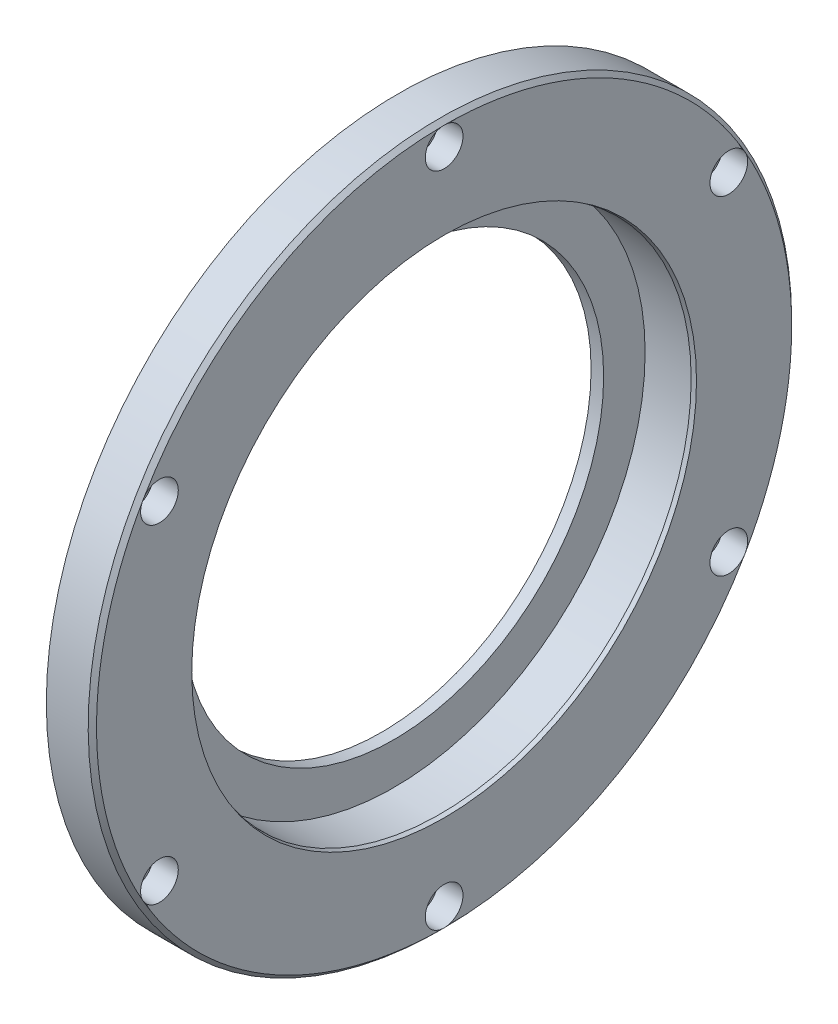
ISO-10303-21;
HEADER;
FILE_DESCRIPTION(('STEP AP214'),'2;1');
FILE_NAME('part.step','',(''),(''),'','','');
FILE_SCHEMA(('AUTOMOTIVE_DESIGN { 1 0 10303 214 1 1 1 1 }'));
ENDSEC;
DATA;
#1=APPLICATION_CONTEXT('core data for automotive mechanical design processes');
#2=APPLICATION_PROTOCOL_DEFINITION('international standard','automotive_design',2000,#1);
#3=PRODUCT_CONTEXT('',#1,'mechanical');
#4=PRODUCT('Part','Part','',(#3));
#5=PRODUCT_RELATED_PRODUCT_CATEGORY('part','',(#4));
#6=PRODUCT_DEFINITION_FORMATION('','',#4);
#7=PRODUCT_DEFINITION_CONTEXT('part definition',#1,'design');
#8=PRODUCT_DEFINITION('design','',#6,#7);
#9=PRODUCT_DEFINITION_SHAPE('','',#8);
#10=(LENGTH_UNIT() NAMED_UNIT(*) SI_UNIT(.MILLI.,.METRE.));
#11=(NAMED_UNIT(*) PLANE_ANGLE_UNIT() SI_UNIT($,.RADIAN.));
#12=(NAMED_UNIT(*) SI_UNIT($,.STERADIAN.) SOLID_ANGLE_UNIT());
#13=UNCERTAINTY_MEASURE_WITH_UNIT(LENGTH_MEASURE(1.E-05),#10,'distance_accuracy_value','');
#14=(GEOMETRIC_REPRESENTATION_CONTEXT(3) GLOBAL_UNCERTAINTY_ASSIGNED_CONTEXT((#13)) GLOBAL_UNIT_ASSIGNED_CONTEXT((#10,
#11,#12)) REPRESENTATION_CONTEXT('',''));
#15=CARTESIAN_POINT('',(0.,0.,0.));
#16=DIRECTION('',(0.,0.,1.));
#17=DIRECTION('',(1.,0.,0.));
#18=AXIS2_PLACEMENT_3D('',#15,#16,#17);
#19=CARTESIAN_POINT('',(0.,0.,0.));
#20=DIRECTION('',(1.,0.,0.));
#21=DIRECTION('',(0.,0.,-1.));
#22=AXIS2_PLACEMENT_3D('',#19,#20,#21);
#23=CYLINDRICAL_SURFACE('',#22,65.);
#24=CARTESIAN_POINT('',(-15.,0.,0.));
#25=DIRECTION('',(1.,0.,0.));
#26=DIRECTION('',(0.,0.,-1.));
#27=AXIS2_PLACEMENT_3D('',#24,#25,#26);
#28=CIRCLE('',#27,65.);
#29=CARTESIAN_POINT('',(-15.,0.,-65.));
#30=VERTEX_POINT('',#29);
#31=EDGE_CURVE('E11',#30,#30,#28,.T.);
#32=ORIENTED_EDGE('',*,*,#31,.T.);
#33=EDGE_LOOP('',(#32));
#34=FACE_BOUND('',#33,.T.);
#35=CARTESIAN_POINT('',(-16.,0.,0.));
#36=DIRECTION('',(1.,0.,0.));
#37=DIRECTION('',(0.,0.,-1.));
#38=AXIS2_PLACEMENT_3D('',#35,#36,#37);
#39=CIRCLE('',#38,65.);
#40=CARTESIAN_POINT('',(-16.,0.,-65.));
#41=VERTEX_POINT('',#40);
#42=EDGE_CURVE('E91',#41,#41,#39,.T.);
#43=ORIENTED_EDGE('',*,*,#42,.F.);
#44=EDGE_LOOP('',(#43));
#45=FACE_BOUND('',#44,.T.);
#46=ADVANCED_FACE('F34',(#34,#45),#23,.F.);
#47=CARTESIAN_POINT('',(-15.,65.,0.));
#48=DIRECTION('',(-1.,0.,0.));
#49=DIRECTION('',(0.,0.,1.));
#50=AXIS2_PLACEMENT_3D('',#47,#48,#49);
#51=PLANE('',#50);
#52=CARTESIAN_POINT('',(-15.,0.,0.));
#53=DIRECTION('',(1.,0.,0.));
#54=DIRECTION('',(0.,0.,-1.));
#55=AXIS2_PLACEMENT_3D('',#52,#53,#54);
#56=CIRCLE('',#55,50.1);
#57=CARTESIAN_POINT('',(-15.,0.,-50.1));
#58=VERTEX_POINT('',#57);
#59=EDGE_CURVE('E42',#58,#58,#56,.T.);
#60=ORIENTED_EDGE('',*,*,#59,.T.);
#61=EDGE_LOOP('',(#60));
#62=FACE_BOUND('',#61,.T.);
#63=ORIENTED_EDGE('',*,*,#31,.F.);
#64=EDGE_LOOP('',(#63));
#65=FACE_BOUND('',#64,.T.);
#66=ADVANCED_FACE('F194',(#62,#65),#51,.T.);
#67=CARTESIAN_POINT('',(0.,0.,0.));
#68=DIRECTION('',(1.,0.,0.));
#69=DIRECTION('',(0.,0.,-1.));
#70=AXIS2_PLACEMENT_3D('',#67,#68,#69);
#71=CYLINDRICAL_SURFACE('',#70,50.1);
#72=CARTESIAN_POINT('',(-12.,0.,0.));
#73=DIRECTION('',(1.,0.,0.));
#74=DIRECTION('',(0.,0.,-1.));
#75=AXIS2_PLACEMENT_3D('',#72,#73,#74);
#76=CIRCLE('',#75,50.1);
#77=CARTESIAN_POINT('',(-12.,0.,-50.1));
#78=VERTEX_POINT('',#77);
#79=EDGE_CURVE('E123',#78,#78,#76,.T.);
#80=ORIENTED_EDGE('',*,*,#79,.T.);
#81=EDGE_LOOP('',(#80));
#82=FACE_BOUND('',#81,.T.);
#83=ORIENTED_EDGE('',*,*,#59,.F.);
#84=EDGE_LOOP('',(#83));
#85=FACE_BOUND('',#84,.T.);
#86=ADVANCED_FACE('F199',(#82,#85),#71,.F.);
#87=CARTESIAN_POINT('',(-12.,50.1,0.));
#88=DIRECTION('',(1.,0.,0.));
#89=DIRECTION('',(0.,0.,-1.));
#90=AXIS2_PLACEMENT_3D('',#87,#88,#89);
#91=PLANE('',#90);
#92=CARTESIAN_POINT('',(-12.,0.,0.));
#93=DIRECTION('',(1.,0.,0.));
#94=DIRECTION('',(0.,0.,-1.));
#95=AXIS2_PLACEMENT_3D('',#92,#93,#94);
#96=CIRCLE('',#95,60.);
#97=CARTESIAN_POINT('',(-12.,0.,-60.));
#98=VERTEX_POINT('',#97);
#99=EDGE_CURVE('E120',#98,#98,#96,.T.);
#100=ORIENTED_EDGE('',*,*,#99,.T.);
#101=EDGE_LOOP('',(#100));
#102=FACE_BOUND('',#101,.T.);
#103=ORIENTED_EDGE('',*,*,#79,.F.);
#104=EDGE_LOOP('',(#103));
#105=FACE_BOUND('',#104,.T.);
#106=ADVANCED_FACE('F503',(#102,#105),#91,.T.);
#107=CARTESIAN_POINT('',(0.,0.,0.));
#108=DIRECTION('',(1.,0.,0.));
#109=DIRECTION('',(0.,0.,-1.));
#110=AXIS2_PLACEMENT_3D('',#107,#108,#109);
#111=CYLINDRICAL_SURFACE('',#110,60.);
#112=CARTESIAN_POINT('',(-1.,0.,0.));
#113=DIRECTION('',(1.,0.,0.));
#114=DIRECTION('',(0.,0.,-1.));
#115=AXIS2_PLACEMENT_3D('',#112,#113,#114);
#116=CIRCLE('',#115,60.);
#117=CARTESIAN_POINT('',(-1.,0.,-60.));
#118=VERTEX_POINT('',#117);
#119=EDGE_CURVE('E117',#118,#118,#116,.T.);
#120=ORIENTED_EDGE('',*,*,#119,.T.);
#121=EDGE_LOOP('',(#120));
#122=FACE_BOUND('',#121,.T.);
#123=ORIENTED_EDGE('',*,*,#99,.F.);
#124=EDGE_LOOP('',(#123));
#125=FACE_BOUND('',#124,.T.);
#126=ADVANCED_FACE('F494',(#122,#125),#111,.F.);
#127=CARTESIAN_POINT('',(-1.,0.,0.));
#128=DIRECTION('',(1.,0.,0.));
#129=DIRECTION('',(0.,0.,-1.));
#130=AXIS2_PLACEMENT_3D('',#127,#128,#129);
#131=CONICAL_SURFACE('',#130,60.,0.26179938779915);
#132=CARTESIAN_POINT('',(0.,0.,0.));
#133=DIRECTION('',(1.,0.,0.));
#134=DIRECTION('',(0.,0.,-1.));
#135=AXIS2_PLACEMENT_3D('',#132,#133,#134);
#136=CIRCLE('',#135,60.2679491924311);
#137=CARTESIAN_POINT('',(0.,0.,-60.2679491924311));
#138=VERTEX_POINT('',#137);
#139=EDGE_CURVE('E114',#138,#138,#136,.T.);
#140=ORIENTED_EDGE('',*,*,#139,.T.);
#141=EDGE_LOOP('',(#140));
#142=FACE_BOUND('',#141,.T.);
#143=ORIENTED_EDGE('',*,*,#119,.F.);
#144=EDGE_LOOP('',(#143));
#145=FACE_BOUND('',#144,.T.);
#146=ADVANCED_FACE('F486',(#142,#145),#131,.F.);
#147=CARTESIAN_POINT('',(0.,60.2679491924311,0.));
#148=DIRECTION('',(1.,0.,0.));
#149=DIRECTION('',(0.,0.,-1.));
#150=AXIS2_PLACEMENT_3D('',#147,#148,#149);
#151=PLANE('',#150);
#152=CARTESIAN_POINT('',(0.,0.,0.));
#153=DIRECTION('',(1.,0.,0.));
#154=DIRECTION('',(0.,0.,-1.));
#155=AXIS2_PLACEMENT_3D('',#152,#153,#154);
#156=CIRCLE('',#155,83.);
#157=CARTESIAN_POINT('',(0.,83.,0.));
#158=VERTEX_POINT('',#157);
#159=CARTESIAN_POINT('',(0.,41.5000000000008,71.8801085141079));
#160=VERTEX_POINT('',#159);
#161=EDGE_CURVE('E84',#158,#160,#156,.T.);
#162=ORIENTED_EDGE('',*,*,#161,.T.);
#163=CARTESIAN_POINT('',(0.,39.2500000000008,67.982994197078));
#164=DIRECTION('',(1.,0.,0.));
#165=DIRECTION('',(0.,0.,-1.));
#166=AXIS2_PLACEMENT_3D('',#163,#164,#165);
#167=CIRCLE('',#166,4.5);
#168=EDGE_CURVE('E48',#160,#160,#167,.T.);
#169=ORIENTED_EDGE('',*,*,#168,.F.);
#170=CARTESIAN_POINT('',(0.,-41.4999999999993,71.8801085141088));
#171=VERTEX_POINT('',#170);
#172=EDGE_CURVE('E54',#160,#171,#156,.T.);
#173=ORIENTED_EDGE('',*,*,#172,.T.);
#174=CARTESIAN_POINT('',(0.,-39.2499999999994,67.9829941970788));
#175=DIRECTION('',(1.,0.,0.));
#176=DIRECTION('',(0.,0.,-1.));
#177=AXIS2_PLACEMENT_3D('',#174,#175,#176);
#178=CIRCLE('',#177,4.5);
#179=EDGE_CURVE('E143',#171,#171,#178,.T.);
#180=ORIENTED_EDGE('',*,*,#179,.F.);
#181=CARTESIAN_POINT('',(0.,-83.,5.79586237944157E-13));
#182=VERTEX_POINT('',#181);
#183=EDGE_CURVE('E418',#171,#182,#156,.T.);
#184=ORIENTED_EDGE('',*,*,#183,.T.);
#185=CARTESIAN_POINT('',(0.,-78.5,5.48162887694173E-13));
#186=DIRECTION('',(1.,0.,0.));
#187=DIRECTION('',(0.,0.,-1.));
#188=AXIS2_PLACEMENT_3D('',#185,#186,#187);
#189=CIRCLE('',#188,4.5);
#190=EDGE_CURVE('E139',#182,#182,#189,.T.);
#191=ORIENTED_EDGE('',*,*,#190,.F.);
#192=CARTESIAN_POINT('',(0.,-41.5000000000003,-71.8801085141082));
#193=VERTEX_POINT('',#192);
#194=EDGE_CURVE('E417',#182,#193,#156,.T.);
#195=ORIENTED_EDGE('',*,*,#194,.T.);
#196=CARTESIAN_POINT('',(0.,-39.2500000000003,-67.9829941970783));
#197=DIRECTION('',(1.,0.,0.));
#198=DIRECTION('',(0.,0.,-1.));
#199=AXIS2_PLACEMENT_3D('',#196,#197,#198);
#200=CIRCLE('',#199,4.5);
#201=EDGE_CURVE('E135',#193,#193,#200,.T.);
#202=ORIENTED_EDGE('',*,*,#201,.F.);
#203=CARTESIAN_POINT('',(0.,41.4999999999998,-71.8801085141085));
#204=VERTEX_POINT('',#203);
#205=EDGE_CURVE('E81',#193,#204,#156,.T.);
#206=ORIENTED_EDGE('',*,*,#205,.T.);
#207=CARTESIAN_POINT('',(0.,39.2499999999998,-67.9829941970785));
#208=DIRECTION('',(1.,0.,0.));
#209=DIRECTION('',(0.,0.,-1.));
#210=AXIS2_PLACEMENT_3D('',#207,#208,#209);
#211=CIRCLE('',#210,4.5);
#212=EDGE_CURVE('E78',#204,#204,#211,.T.);
#213=ORIENTED_EDGE('',*,*,#212,.F.);
#214=EDGE_CURVE('E70',#204,#158,#156,.T.);
#215=ORIENTED_EDGE('',*,*,#214,.T.);
#216=CARTESIAN_POINT('',(0.,78.5,0.));
#217=DIRECTION('',(1.,0.,0.));
#218=DIRECTION('',(0.,0.,-1.));
#219=AXIS2_PLACEMENT_3D('',#216,#217,#218);
#220=CIRCLE('',#219,4.5);
#221=EDGE_CURVE('E75',#158,#158,#220,.T.);
#222=ORIENTED_EDGE('',*,*,#221,.F.);
#223=EDGE_LOOP('',(#162,#169,#173,#180,#184,#191,#195,#202,#206,#213,#215,#222));
#224=FACE_BOUND('',#223,.T.);
#225=ORIENTED_EDGE('',*,*,#139,.F.);
#226=EDGE_LOOP('',(#225));
#227=FACE_BOUND('',#226,.T.);
#228=ADVANCED_FACE('F73',(#224,#227),#151,.T.);
#229=CARTESIAN_POINT('',(0.,0.,0.));
#230=DIRECTION('',(-1.,0.,0.));
#231=DIRECTION('',(0.,0.,1.));
#232=AXIS2_PLACEMENT_3D('',#229,#230,#231);
#233=CONICAL_SURFACE('',#232,83.,0.785398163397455);
#234=CARTESIAN_POINT('',(-1.,0.,0.));
#235=DIRECTION('',(1.,0.,0.));
#236=DIRECTION('',(0.,0.,-1.));
#237=AXIS2_PLACEMENT_3D('',#234,#235,#236);
#238=CIRCLE('',#237,84.);
#239=CARTESIAN_POINT('',(-1.,0.,-84.));
#240=VERTEX_POINT('',#239);
#241=EDGE_CURVE('E82',#240,#240,#238,.T.);
#242=ORIENTED_EDGE('',*,*,#241,.T.);
#243=EDGE_LOOP('',(#242));
#244=FACE_BOUND('',#243,.T.);
#245=ORIENTED_EDGE('',*,*,#161,.F.);
#246=ORIENTED_EDGE('',*,*,#214,.F.);
#247=ORIENTED_EDGE('',*,*,#205,.F.);
#248=ORIENTED_EDGE('',*,*,#194,.F.);
#249=ORIENTED_EDGE('',*,*,#183,.F.);
#250=ORIENTED_EDGE('',*,*,#172,.F.);
#251=EDGE_LOOP('',(#245,#246,#247,#248,#249,#250));
#252=FACE_BOUND('',#251,.T.);
#253=ADVANCED_FACE('F228',(#244,#252),#233,.T.);
#254=CARTESIAN_POINT('',(0.,0.,0.));
#255=DIRECTION('',(1.,0.,0.));
#256=DIRECTION('',(0.,0.,-1.));
#257=AXIS2_PLACEMENT_3D('',#254,#255,#256);
#258=CYLINDRICAL_SURFACE('',#257,84.);
#259=CARTESIAN_POINT('',(-11.,0.,0.));
#260=DIRECTION('',(1.,0.,0.));
#261=DIRECTION('',(0.,0.,-1.));
#262=AXIS2_PLACEMENT_3D('',#259,#260,#261);
#263=CIRCLE('',#262,84.);
#264=CARTESIAN_POINT('',(-11.,0.,-84.));
#265=VERTEX_POINT('',#264);
#266=EDGE_CURVE('E109',#265,#265,#263,.T.);
#267=ORIENTED_EDGE('',*,*,#266,.T.);
#268=EDGE_LOOP('',(#267));
#269=FACE_BOUND('',#268,.T.);
#270=ORIENTED_EDGE('',*,*,#241,.F.);
#271=EDGE_LOOP('',(#270));
#272=FACE_BOUND('',#271,.T.);
#273=ADVANCED_FACE('F221',(#269,#272),#258,.T.);
#274=CARTESIAN_POINT('',(-11.,84.,0.));
#275=DIRECTION('',(-1.,0.,0.));
#276=DIRECTION('',(0.,0.,1.));
#277=AXIS2_PLACEMENT_3D('',#274,#275,#276);
#278=PLANE('',#277);
#279=CARTESIAN_POINT('',(-11.,39.2500000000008,67.982994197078));
#280=DIRECTION('',(-1.,0.,0.));
#281=DIRECTION('',(0.,0.,1.));
#282=AXIS2_PLACEMENT_3D('',#279,#280,#281);
#283=CIRCLE('',#282,3.);
#284=CARTESIAN_POINT('',(-11.,39.2500000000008,70.982994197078));
#285=VERTEX_POINT('',#284);
#286=EDGE_CURVE('E37',#285,#285,#283,.T.);
#287=ORIENTED_EDGE('',*,*,#286,.F.);
#288=EDGE_LOOP('',(#287));
#289=FACE_BOUND('',#288,.T.);
#290=CARTESIAN_POINT('',(-11.,-39.2499999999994,67.9829941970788));
#291=DIRECTION('',(-1.,0.,0.));
#292=DIRECTION('',(0.,0.,1.));
#293=AXIS2_PLACEMENT_3D('',#290,#291,#292);
#294=CIRCLE('',#293,3.);
#295=CARTESIAN_POINT('',(-11.,-39.2499999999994,70.9829941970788));
#296=VERTEX_POINT('',#295);
#297=EDGE_CURVE('E140',#296,#296,#294,.T.);
#298=ORIENTED_EDGE('',*,*,#297,.F.);
#299=EDGE_LOOP('',(#298));
#300=FACE_BOUND('',#299,.T.);
#301=CARTESIAN_POINT('',(-11.,-78.5,5.48162887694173E-13));
#302=DIRECTION('',(-1.,0.,0.));
#303=DIRECTION('',(0.,0.,1.));
#304=AXIS2_PLACEMENT_3D('',#301,#302,#303);
#305=CIRCLE('',#304,3.);
#306=CARTESIAN_POINT('',(-11.,-78.5,3.00000000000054));
#307=VERTEX_POINT('',#306);
#308=EDGE_CURVE('E136',#307,#307,#305,.T.);
#309=ORIENTED_EDGE('',*,*,#308,.F.);
#310=EDGE_LOOP('',(#309));
#311=FACE_BOUND('',#310,.T.);
#312=CARTESIAN_POINT('',(-11.,-39.2500000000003,-67.9829941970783));
#313=DIRECTION('',(-1.,0.,0.));
#314=DIRECTION('',(0.,0.,1.));
#315=AXIS2_PLACEMENT_3D('',#312,#313,#314);
#316=CIRCLE('',#315,3.);
#317=CARTESIAN_POINT('',(-11.,-39.2500000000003,-64.9829941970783));
#318=VERTEX_POINT('',#317);
#319=EDGE_CURVE('E131',#318,#318,#316,.T.);
#320=ORIENTED_EDGE('',*,*,#319,.F.);
#321=EDGE_LOOP('',(#320));
#322=FACE_BOUND('',#321,.T.);
#323=CARTESIAN_POINT('',(-11.,39.2499999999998,-67.9829941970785));
#324=DIRECTION('',(-1.,0.,0.));
#325=DIRECTION('',(0.,0.,1.));
#326=AXIS2_PLACEMENT_3D('',#323,#324,#325);
#327=CIRCLE('',#326,3.);
#328=CARTESIAN_POINT('',(-11.,39.2499999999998,-64.9829941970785));
#329=VERTEX_POINT('',#328);
#330=EDGE_CURVE('E128',#329,#329,#327,.T.);
#331=ORIENTED_EDGE('',*,*,#330,.F.);
#332=EDGE_LOOP('',(#331));
#333=FACE_BOUND('',#332,.T.);
#334=CARTESIAN_POINT('',(-11.,78.5,0.));
#335=DIRECTION('',(-1.,0.,0.));
#336=DIRECTION('',(0.,0.,1.));
#337=AXIS2_PLACEMENT_3D('',#334,#335,#336);
#338=CIRCLE('',#337,3.);
#339=CARTESIAN_POINT('',(-11.,78.5,3.));
#340=VERTEX_POINT('',#339);
#341=EDGE_CURVE('E87',#340,#340,#338,.T.);
#342=ORIENTED_EDGE('',*,*,#341,.F.);
#343=EDGE_LOOP('',(#342));
#344=FACE_BOUND('',#343,.T.);
#345=CARTESIAN_POINT('',(-11.,0.,0.));
#346=DIRECTION('',(1.,0.,0.));
#347=DIRECTION('',(0.,0.,-1.));
#348=AXIS2_PLACEMENT_3D('',#345,#346,#347);
#349=CIRCLE('',#348,75.);
#350=CARTESIAN_POINT('',(-11.,0.,-75.));
#351=VERTEX_POINT('',#350);
#352=EDGE_CURVE('E106',#351,#351,#349,.T.);
#353=ORIENTED_EDGE('',*,*,#352,.T.);
#354=EDGE_LOOP('',(#353));
#355=FACE_BOUND('',#354,.T.);
#356=ORIENTED_EDGE('',*,*,#266,.F.);
#357=EDGE_LOOP('',(#356));
#358=FACE_BOUND('',#357,.T.);
#359=ADVANCED_FACE('F215',(#289,#300,#311,#322,#333,#344,#355,#358),#278,.T.);
#360=CARTESIAN_POINT('',(0.,0.,0.));
#361=DIRECTION('',(1.,0.,0.));
#362=DIRECTION('',(0.,0.,-1.));
#363=AXIS2_PLACEMENT_3D('',#360,#361,#362);
#364=CYLINDRICAL_SURFACE('',#363,75.);
#365=CARTESIAN_POINT('',(-15.,0.,0.));
#366=DIRECTION('',(1.,0.,0.));
#367=DIRECTION('',(0.,0.,-1.));
#368=AXIS2_PLACEMENT_3D('',#365,#366,#367);
#369=CIRCLE('',#368,75.);
#370=CARTESIAN_POINT('',(-15.,0.,-75.));
#371=VERTEX_POINT('',#370);
#372=EDGE_CURVE('E103',#371,#371,#369,.T.);
#373=ORIENTED_EDGE('',*,*,#372,.T.);
#374=EDGE_LOOP('',(#373));
#375=FACE_BOUND('',#374,.T.);
#376=ORIENTED_EDGE('',*,*,#352,.F.);
#377=EDGE_LOOP('',(#376));
#378=FACE_BOUND('',#377,.T.);
#379=ADVANCED_FACE('F209',(#375,#378),#364,.T.);
#380=CARTESIAN_POINT('',(-15.,0.,0.));
#381=DIRECTION('',(1.,0.,0.));
#382=DIRECTION('',(0.,0.,-1.));
#383=AXIS2_PLACEMENT_3D('',#380,#381,#382);
#384=CONICAL_SURFACE('',#383,75.,0.523598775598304);
#385=CARTESIAN_POINT('',(-16.,0.,0.));
#386=DIRECTION('',(1.,0.,0.));
#387=DIRECTION('',(0.,0.,-1.));
#388=AXIS2_PLACEMENT_3D('',#385,#386,#387);
#389=CIRCLE('',#388,74.4226497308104);
#390=CARTESIAN_POINT('',(-16.,0.,-74.4226497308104));
#391=VERTEX_POINT('',#390);
#392=EDGE_CURVE('E100',#391,#391,#389,.T.);
#393=ORIENTED_EDGE('',*,*,#392,.T.);
#394=EDGE_LOOP('',(#393));
#395=FACE_BOUND('',#394,.T.);
#396=ORIENTED_EDGE('',*,*,#372,.F.);
#397=EDGE_LOOP('',(#396));
#398=FACE_BOUND('',#397,.T.);
#399=ADVANCED_FACE('F190',(#395,#398),#384,.T.);
#400=CARTESIAN_POINT('',(-16.,74.4226497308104,0.));
#401=DIRECTION('',(-1.,0.,0.));
#402=DIRECTION('',(0.,0.,1.));
#403=AXIS2_PLACEMENT_3D('',#400,#401,#402);
#404=PLANE('',#403);
#405=ORIENTED_EDGE('',*,*,#42,.T.);
#406=EDGE_LOOP('',(#405));
#407=FACE_BOUND('',#406,.T.);
#408=ORIENTED_EDGE('',*,*,#392,.F.);
#409=EDGE_LOOP('',(#408));
#410=FACE_BOUND('',#409,.T.);
#411=ADVANCED_FACE('F185',(#407,#410),#404,.T.);
#412=CARTESIAN_POINT('',(0.,78.5,0.));
#413=DIRECTION('',(1.,0.,0.));
#414=DIRECTION('',(0.,0.,-1.));
#415=AXIS2_PLACEMENT_3D('',#412,#413,#414);
#416=CYLINDRICAL_SURFACE('',#415,4.5);
#417=CARTESIAN_POINT('',(-6.00000000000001,78.5,0.));
#418=DIRECTION('',(1.,0.,0.));
#419=DIRECTION('',(0.,0.,-1.));
#420=AXIS2_PLACEMENT_3D('',#417,#418,#419);
#421=CIRCLE('',#420,4.5);
#422=CARTESIAN_POINT('',(-6.00000000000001,78.5,-4.5));
#423=VERTEX_POINT('',#422);
#424=EDGE_CURVE('E88',#423,#423,#421,.T.);
#425=ORIENTED_EDGE('',*,*,#424,.F.);
#426=EDGE_LOOP('',(#425));
#427=FACE_BOUND('',#426,.T.);
#428=ORIENTED_EDGE('',*,*,#221,.T.);
#429=EDGE_LOOP('',(#428));
#430=FACE_BOUND('',#429,.T.);
#431=ADVANCED_FACE('F86',(#427,#430),#416,.F.);
#432=CARTESIAN_POINT('',(-6.00000000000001,81.5,0.));
#433=DIRECTION('',(-1.,0.,0.));
#434=DIRECTION('',(0.,0.,1.));
#435=AXIS2_PLACEMENT_3D('',#432,#433,#434);
#436=PLANE('',#435);
#437=CARTESIAN_POINT('',(-6.00000000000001,78.5,0.));
#438=DIRECTION('',(1.,0.,0.));
#439=DIRECTION('',(0.,0.,-1.));
#440=AXIS2_PLACEMENT_3D('',#437,#438,#439);
#441=CIRCLE('',#440,3.);
#442=CARTESIAN_POINT('',(-6.00000000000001,78.5,-3.));
#443=VERTEX_POINT('',#442);
#444=EDGE_CURVE('E94',#443,#443,#441,.T.);
#445=ORIENTED_EDGE('',*,*,#444,.F.);
#446=EDGE_LOOP('',(#445));
#447=FACE_BOUND('',#446,.T.);
#448=ORIENTED_EDGE('',*,*,#424,.T.);
#449=EDGE_LOOP('',(#448));
#450=FACE_BOUND('',#449,.T.);
#451=ADVANCED_FACE('F178',(#447,#450),#436,.F.);
#452=CARTESIAN_POINT('',(0.,78.5,0.));
#453=DIRECTION('',(1.,0.,0.));
#454=DIRECTION('',(0.,0.,-1.));
#455=AXIS2_PLACEMENT_3D('',#452,#453,#454);
#456=CYLINDRICAL_SURFACE('',#455,3.);
#457=ORIENTED_EDGE('',*,*,#341,.T.);
#458=EDGE_LOOP('',(#457));
#459=FACE_BOUND('',#458,.T.);
#460=ORIENTED_EDGE('',*,*,#444,.T.);
#461=EDGE_LOOP('',(#460));
#462=FACE_BOUND('',#461,.T.);
#463=ADVANCED_FACE('F176',(#459,#462),#456,.F.);
#464=CARTESIAN_POINT('',(0.,39.2499999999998,-67.9829941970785));
#465=DIRECTION('',(1.,0.,0.));
#466=DIRECTION('',(0.,0.,-1.));
#467=AXIS2_PLACEMENT_3D('',#464,#465,#466);
#468=CYLINDRICAL_SURFACE('',#467,4.5);
#469=CARTESIAN_POINT('',(-6.00000000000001,39.2499999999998,-67.9829941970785));
#470=DIRECTION('',(1.,0.,0.));
#471=DIRECTION('',(0.,0.,-1.));
#472=AXIS2_PLACEMENT_3D('',#469,#470,#471);
#473=CIRCLE('',#472,4.5);
#474=CARTESIAN_POINT('',(-6.00000000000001,39.2499999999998,-72.4829941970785));
#475=VERTEX_POINT('',#474);
#476=EDGE_CURVE('E170',#475,#475,#473,.T.);
#477=ORIENTED_EDGE('',*,*,#476,.F.);
#478=EDGE_LOOP('',(#477));
#479=FACE_BOUND('',#478,.T.);
#480=ORIENTED_EDGE('',*,*,#212,.T.);
#481=EDGE_LOOP('',(#480));
#482=FACE_BOUND('',#481,.T.);
#483=ADVANCED_FACE('F291',(#479,#482),#468,.F.);
#484=CARTESIAN_POINT('',(-6.00000000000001,42.2499999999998,-67.9829941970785));
#485=DIRECTION('',(-1.,0.,0.));
#486=DIRECTION('',(0.,0.,1.));
#487=AXIS2_PLACEMENT_3D('',#484,#485,#486);
#488=PLANE('',#487);
#489=CARTESIAN_POINT('',(-6.00000000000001,39.2499999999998,-67.9829941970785));
#490=DIRECTION('',(1.,0.,0.));
#491=DIRECTION('',(0.,0.,-1.));
#492=AXIS2_PLACEMENT_3D('',#489,#490,#491);
#493=CIRCLE('',#492,3.);
#494=CARTESIAN_POINT('',(-6.00000000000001,39.2499999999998,-70.9829941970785));
#495=VERTEX_POINT('',#494);
#496=EDGE_CURVE('E134',#495,#495,#493,.T.);
#497=ORIENTED_EDGE('',*,*,#496,.F.);
#498=EDGE_LOOP('',(#497));
#499=FACE_BOUND('',#498,.T.);
#500=ORIENTED_EDGE('',*,*,#476,.T.);
#501=EDGE_LOOP('',(#500));
#502=FACE_BOUND('',#501,.T.);
#503=ADVANCED_FACE('F287',(#499,#502),#488,.F.);
#504=CARTESIAN_POINT('',(0.,39.2499999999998,-67.9829941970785));
#505=DIRECTION('',(1.,0.,0.));
#506=DIRECTION('',(0.,0.,-1.));
#507=AXIS2_PLACEMENT_3D('',#504,#505,#506);
#508=CYLINDRICAL_SURFACE('',#507,3.);
#509=ORIENTED_EDGE('',*,*,#330,.T.);
#510=EDGE_LOOP('',(#509));
#511=FACE_BOUND('',#510,.T.);
#512=ORIENTED_EDGE('',*,*,#496,.T.);
#513=EDGE_LOOP('',(#512));
#514=FACE_BOUND('',#513,.T.);
#515=ADVANCED_FACE('F283',(#511,#514),#508,.F.);
#516=CARTESIAN_POINT('',(0.,-39.2500000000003,-67.9829941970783));
#517=DIRECTION('',(1.,0.,0.));
#518=DIRECTION('',(0.,0.,-1.));
#519=AXIS2_PLACEMENT_3D('',#516,#517,#518);
#520=CYLINDRICAL_SURFACE('',#519,4.5);
#521=CARTESIAN_POINT('',(-6.00000000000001,-39.2500000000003,-67.9829941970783));
#522=DIRECTION('',(1.,0.,0.));
#523=DIRECTION('',(0.,0.,-1.));
#524=AXIS2_PLACEMENT_3D('',#521,#522,#523);
#525=CIRCLE('',#524,4.5);
#526=CARTESIAN_POINT('',(-6.00000000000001,-39.2500000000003,-72.4829941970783));
#527=VERTEX_POINT('',#526);
#528=EDGE_CURVE('E163',#527,#527,#525,.T.);
#529=ORIENTED_EDGE('',*,*,#528,.F.);
#530=EDGE_LOOP('',(#529));
#531=FACE_BOUND('',#530,.T.);
#532=ORIENTED_EDGE('',*,*,#201,.T.);
#533=EDGE_LOOP('',(#532));
#534=FACE_BOUND('',#533,.T.);
#535=ADVANCED_FACE('F279',(#531,#534),#520,.F.);
#536=CARTESIAN_POINT('',(-6.00000000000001,-36.2500000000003,-67.9829941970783));
#537=DIRECTION('',(-1.,0.,0.));
#538=DIRECTION('',(0.,0.,1.));
#539=AXIS2_PLACEMENT_3D('',#536,#537,#538);
#540=PLANE('',#539);
#541=CARTESIAN_POINT('',(-6.00000000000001,-39.2500000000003,-67.9829941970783));
#542=DIRECTION('',(1.,0.,0.));
#543=DIRECTION('',(0.,0.,-1.));
#544=AXIS2_PLACEMENT_3D('',#541,#542,#543);
#545=CIRCLE('',#544,3.);
#546=CARTESIAN_POINT('',(-6.00000000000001,-39.2500000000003,-70.9829941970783));
#547=VERTEX_POINT('',#546);
#548=EDGE_CURVE('E138',#547,#547,#545,.T.);
#549=ORIENTED_EDGE('',*,*,#548,.F.);
#550=EDGE_LOOP('',(#549));
#551=FACE_BOUND('',#550,.T.);
#552=ORIENTED_EDGE('',*,*,#528,.T.);
#553=EDGE_LOOP('',(#552));
#554=FACE_BOUND('',#553,.T.);
#555=ADVANCED_FACE('F275',(#551,#554),#540,.F.);
#556=CARTESIAN_POINT('',(0.,-39.2500000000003,-67.9829941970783));
#557=DIRECTION('',(1.,0.,0.));
#558=DIRECTION('',(0.,0.,-1.));
#559=AXIS2_PLACEMENT_3D('',#556,#557,#558);
#560=CYLINDRICAL_SURFACE('',#559,3.);
#561=ORIENTED_EDGE('',*,*,#319,.T.);
#562=EDGE_LOOP('',(#561));
#563=FACE_BOUND('',#562,.T.);
#564=ORIENTED_EDGE('',*,*,#548,.T.);
#565=EDGE_LOOP('',(#564));
#566=FACE_BOUND('',#565,.T.);
#567=ADVANCED_FACE('F271',(#563,#566),#560,.F.);
#568=CARTESIAN_POINT('',(0.,-78.5,5.48162887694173E-13));
#569=DIRECTION('',(1.,0.,0.));
#570=DIRECTION('',(0.,0.,-1.));
#571=AXIS2_PLACEMENT_3D('',#568,#569,#570);
#572=CYLINDRICAL_SURFACE('',#571,4.5);
#573=CARTESIAN_POINT('',(-6.00000000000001,-78.5,5.48162887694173E-13));
#574=DIRECTION('',(1.,0.,0.));
#575=DIRECTION('',(0.,0.,-1.));
#576=AXIS2_PLACEMENT_3D('',#573,#574,#575);
#577=CIRCLE('',#576,4.5);
#578=CARTESIAN_POINT('',(-6.00000000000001,-78.5,-4.49999999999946));
#579=VERTEX_POINT('',#578);
#580=EDGE_CURVE('E147',#579,#579,#577,.T.);
#581=ORIENTED_EDGE('',*,*,#580,.F.);
#582=EDGE_LOOP('',(#581));
#583=FACE_BOUND('',#582,.T.);
#584=ORIENTED_EDGE('',*,*,#190,.T.);
#585=EDGE_LOOP('',(#584));
#586=FACE_BOUND('',#585,.T.);
#587=ADVANCED_FACE('F267',(#583,#586),#572,.F.);
#588=CARTESIAN_POINT('',(-6.00000000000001,-75.5,5.48162887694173E-13));
#589=DIRECTION('',(-1.,0.,0.));
#590=DIRECTION('',(0.,0.,1.));
#591=AXIS2_PLACEMENT_3D('',#588,#589,#590);
#592=PLANE('',#591);
#593=CARTESIAN_POINT('',(-6.00000000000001,-78.5,5.48162887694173E-13));
#594=DIRECTION('',(1.,0.,0.));
#595=DIRECTION('',(0.,0.,-1.));
#596=AXIS2_PLACEMENT_3D('',#593,#594,#595);
#597=CIRCLE('',#596,3.);
#598=CARTESIAN_POINT('',(-6.00000000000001,-78.5,-2.99999999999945));
#599=VERTEX_POINT('',#598);
#600=EDGE_CURVE('E142',#599,#599,#597,.T.);
#601=ORIENTED_EDGE('',*,*,#600,.F.);
#602=EDGE_LOOP('',(#601));
#603=FACE_BOUND('',#602,.T.);
#604=ORIENTED_EDGE('',*,*,#580,.T.);
#605=EDGE_LOOP('',(#604));
#606=FACE_BOUND('',#605,.T.);
#607=ADVANCED_FACE('F260',(#603,#606),#592,.F.);
#608=CARTESIAN_POINT('',(0.,-78.5,5.48162887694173E-13));
#609=DIRECTION('',(1.,0.,0.));
#610=DIRECTION('',(0.,0.,-1.));
#611=AXIS2_PLACEMENT_3D('',#608,#609,#610);
#612=CYLINDRICAL_SURFACE('',#611,3.);
#613=ORIENTED_EDGE('',*,*,#308,.T.);
#614=EDGE_LOOP('',(#613));
#615=FACE_BOUND('',#614,.T.);
#616=ORIENTED_EDGE('',*,*,#600,.T.);
#617=EDGE_LOOP('',(#616));
#618=FACE_BOUND('',#617,.T.);
#619=ADVANCED_FACE('F255',(#615,#618),#612,.F.);
#620=CARTESIAN_POINT('',(0.,-39.2499999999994,67.9829941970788));
#621=DIRECTION('',(1.,0.,0.));
#622=DIRECTION('',(0.,0.,-1.));
#623=AXIS2_PLACEMENT_3D('',#620,#621,#622);
#624=CYLINDRICAL_SURFACE('',#623,4.5);
#625=CARTESIAN_POINT('',(-6.00000000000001,-39.2499999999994,67.9829941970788));
#626=DIRECTION('',(1.,0.,0.));
#627=DIRECTION('',(0.,0.,-1.));
#628=AXIS2_PLACEMENT_3D('',#625,#626,#627);
#629=CIRCLE('',#628,4.5);
#630=CARTESIAN_POINT('',(-6.00000000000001,-39.2499999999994,63.4829941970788));
#631=VERTEX_POINT('',#630);
#632=EDGE_CURVE('E149',#631,#631,#629,.T.);
#633=ORIENTED_EDGE('',*,*,#632,.F.);
#634=EDGE_LOOP('',(#633));
#635=FACE_BOUND('',#634,.T.);
#636=ORIENTED_EDGE('',*,*,#179,.T.);
#637=EDGE_LOOP('',(#636));
#638=FACE_BOUND('',#637,.T.);
#639=ADVANCED_FACE('F250',(#635,#638),#624,.F.);
#640=CARTESIAN_POINT('',(-6.00000000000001,-36.2499999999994,67.9829941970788));
#641=DIRECTION('',(-1.,0.,0.));
#642=DIRECTION('',(0.,0.,1.));
#643=AXIS2_PLACEMENT_3D('',#640,#641,#642);
#644=PLANE('',#643);
#645=CARTESIAN_POINT('',(-6.00000000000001,-39.2499999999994,67.9829941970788));
#646=DIRECTION('',(1.,0.,0.));
#647=DIRECTION('',(0.,0.,-1.));
#648=AXIS2_PLACEMENT_3D('',#645,#646,#647);
#649=CIRCLE('',#648,3.);
#650=CARTESIAN_POINT('',(-6.00000000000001,-39.2499999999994,64.9829941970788));
#651=VERTEX_POINT('',#650);
#652=EDGE_CURVE('E153',#651,#651,#649,.T.);
#653=ORIENTED_EDGE('',*,*,#652,.F.);
#654=EDGE_LOOP('',(#653));
#655=FACE_BOUND('',#654,.T.);
#656=ORIENTED_EDGE('',*,*,#632,.T.);
#657=EDGE_LOOP('',(#656));
#658=FACE_BOUND('',#657,.T.);
#659=ADVANCED_FACE('F247',(#655,#658),#644,.F.);
#660=CARTESIAN_POINT('',(0.,-39.2499999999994,67.9829941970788));
#661=DIRECTION('',(1.,0.,0.));
#662=DIRECTION('',(0.,0.,-1.));
#663=AXIS2_PLACEMENT_3D('',#660,#661,#662);
#664=CYLINDRICAL_SURFACE('',#663,3.);
#665=ORIENTED_EDGE('',*,*,#297,.T.);
#666=EDGE_LOOP('',(#665));
#667=FACE_BOUND('',#666,.T.);
#668=ORIENTED_EDGE('',*,*,#652,.T.);
#669=EDGE_LOOP('',(#668));
#670=FACE_BOUND('',#669,.T.);
#671=ADVANCED_FACE('F245',(#667,#670),#664,.F.);
#672=CARTESIAN_POINT('',(0.,39.2500000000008,67.982994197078));
#673=DIRECTION('',(1.,0.,0.));
#674=DIRECTION('',(0.,0.,-1.));
#675=AXIS2_PLACEMENT_3D('',#672,#673,#674);
#676=CYLINDRICAL_SURFACE('',#675,4.5);
#677=CARTESIAN_POINT('',(-6.00000000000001,39.2500000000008,67.982994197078));
#678=DIRECTION('',(1.,0.,0.));
#679=DIRECTION('',(0.,0.,-1.));
#680=AXIS2_PLACEMENT_3D('',#677,#678,#679);
#681=CIRCLE('',#680,4.5);
#682=CARTESIAN_POINT('',(-6.00000000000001,39.2500000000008,63.482994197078));
#683=VERTEX_POINT('',#682);
#684=EDGE_CURVE('E235',#683,#683,#681,.T.);
#685=ORIENTED_EDGE('',*,*,#684,.F.);
#686=EDGE_LOOP('',(#685));
#687=FACE_BOUND('',#686,.T.);
#688=ORIENTED_EDGE('',*,*,#168,.T.);
#689=EDGE_LOOP('',(#688));
#690=FACE_BOUND('',#689,.T.);
#691=ADVANCED_FACE('F359',(#687,#690),#676,.F.);
#692=CARTESIAN_POINT('',(-6.00000000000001,42.2500000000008,67.982994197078));
#693=DIRECTION('',(-1.,0.,0.));
#694=DIRECTION('',(0.,0.,1.));
#695=AXIS2_PLACEMENT_3D('',#692,#693,#694);
#696=PLANE('',#695);
#697=CARTESIAN_POINT('',(-6.00000000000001,39.2500000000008,67.982994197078));
#698=DIRECTION('',(1.,0.,0.));
#699=DIRECTION('',(0.,0.,-1.));
#700=AXIS2_PLACEMENT_3D('',#697,#698,#699);
#701=CIRCLE('',#700,3.);
#702=CARTESIAN_POINT('',(-6.00000000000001,39.2500000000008,64.982994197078));
#703=VERTEX_POINT('',#702);
#704=EDGE_CURVE('E239',#703,#703,#701,.T.);
#705=ORIENTED_EDGE('',*,*,#704,.F.);
#706=EDGE_LOOP('',(#705));
#707=FACE_BOUND('',#706,.T.);
#708=ORIENTED_EDGE('',*,*,#684,.T.);
#709=EDGE_LOOP('',(#708));
#710=FACE_BOUND('',#709,.T.);
#711=ADVANCED_FACE('F367',(#707,#710),#696,.F.);
#712=CARTESIAN_POINT('',(0.,39.2500000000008,67.982994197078));
#713=DIRECTION('',(1.,0.,0.));
#714=DIRECTION('',(0.,0.,-1.));
#715=AXIS2_PLACEMENT_3D('',#712,#713,#714);
#716=CYLINDRICAL_SURFACE('',#715,3.);
#717=ORIENTED_EDGE('',*,*,#286,.T.);
#718=EDGE_LOOP('',(#717));
#719=FACE_BOUND('',#718,.T.);
#720=ORIENTED_EDGE('',*,*,#704,.T.);
#721=EDGE_LOOP('',(#720));
#722=FACE_BOUND('',#721,.T.);
#723=ADVANCED_FACE('F377',(#719,#722),#716,.F.);
#724=CLOSED_SHELL('',(#46,#66,#86,#106,#126,#146,#228,#253,#273,#359,#379,#399,#411,#431,#451,
#463,#483,#503,#515,#535,#555,#567,#587,#607,#619,#639,#659,#671,#691,#711,#723));
#725=MANIFOLD_SOLID_BREP('B2',#724);
#726=ADVANCED_BREP_SHAPE_REPRESENTATION('',(#18,#725),#14);
#727=SHAPE_DEFINITION_REPRESENTATION(#9,#726);
ENDSEC;
END-ISO-10303-21;
